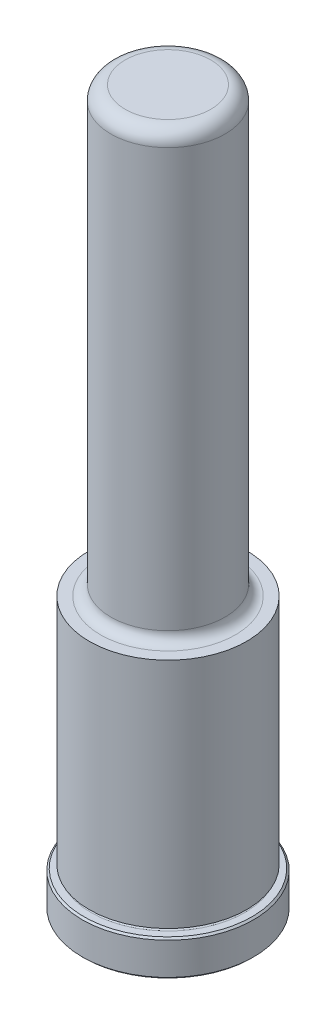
ISO-10303-21;
HEADER;
FILE_DESCRIPTION(('STEP AP214'),'2;1');
FILE_NAME('part.step','',(''),(''),'','','');
FILE_SCHEMA(('AUTOMOTIVE_DESIGN { 1 0 10303 214 1 1 1 1 }'));
ENDSEC;
DATA;
#1=APPLICATION_CONTEXT('core data for automotive mechanical design processes');
#2=APPLICATION_PROTOCOL_DEFINITION('international standard','automotive_design',2000,#1);
#3=PRODUCT_CONTEXT('',#1,'mechanical');
#4=PRODUCT('Part','Part','',(#3));
#5=PRODUCT_RELATED_PRODUCT_CATEGORY('part','',(#4));
#6=PRODUCT_DEFINITION_FORMATION('','',#4);
#7=PRODUCT_DEFINITION_CONTEXT('part definition',#1,'design');
#8=PRODUCT_DEFINITION('design','',#6,#7);
#9=PRODUCT_DEFINITION_SHAPE('','',#8);
#10=(LENGTH_UNIT() NAMED_UNIT(*) SI_UNIT(.MILLI.,.METRE.));
#11=(NAMED_UNIT(*) PLANE_ANGLE_UNIT() SI_UNIT($,.RADIAN.));
#12=(NAMED_UNIT(*) SI_UNIT($,.STERADIAN.) SOLID_ANGLE_UNIT());
#13=UNCERTAINTY_MEASURE_WITH_UNIT(LENGTH_MEASURE(1.E-05),#10,'distance_accuracy_value','');
#14=(GEOMETRIC_REPRESENTATION_CONTEXT(3) GLOBAL_UNCERTAINTY_ASSIGNED_CONTEXT((#13)) GLOBAL_UNIT_ASSIGNED_CONTEXT((#10,
#11,#12)) REPRESENTATION_CONTEXT('',''));
#15=CARTESIAN_POINT('',(0.,0.,0.));
#16=DIRECTION('',(0.,0.,1.));
#17=DIRECTION('',(1.,0.,0.));
#18=AXIS2_PLACEMENT_3D('',#15,#16,#17);
#19=CARTESIAN_POINT('',(0.,0.,0.));
#20=DIRECTION('',(0.,1.,0.));
#21=DIRECTION('',(0.,0.,1.));
#22=AXIS2_PLACEMENT_3D('',#19,#20,#21);
#23=PLANE('',#22);
#24=CARTESIAN_POINT('',(0.,0.,0.));
#25=DIRECTION('',(0.,1.,0.));
#26=DIRECTION('',(0.,0.,1.));
#27=AXIS2_PLACEMENT_3D('',#24,#25,#26);
#28=CIRCLE('',#27,18.669);
#29=CARTESIAN_POINT('',(0.,0.,18.669));
#30=VERTEX_POINT('',#29);
#31=EDGE_CURVE('E46',#30,#30,#28,.F.);
#32=ORIENTED_EDGE('',*,*,#31,.T.);
#33=EDGE_LOOP('',(#32));
#34=FACE_BOUND('',#33,.T.);
#35=ADVANCED_FACE('F31',(#34),#23,.F.);
#36=CARTESIAN_POINT('',(0.,0.,0.));
#37=DIRECTION('',(0.,1.,0.));
#38=DIRECTION('',(0.,0.,1.));
#39=AXIS2_PLACEMENT_3D('',#36,#37,#38);
#40=CYLINDRICAL_SURFACE('',#39,19.05);
#41=CARTESIAN_POINT('',(0.,0.380999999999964,0.));
#42=DIRECTION('',(0.,1.,0.));
#43=DIRECTION('',(0.,0.,1.));
#44=AXIS2_PLACEMENT_3D('',#41,#42,#43);
#45=CIRCLE('',#44,19.05);
#46=CARTESIAN_POINT('',(0.,0.380999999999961,19.05));
#47=VERTEX_POINT('',#46);
#48=EDGE_CURVE('E51',#47,#47,#45,.T.);
#49=ORIENTED_EDGE('',*,*,#48,.T.);
#50=EDGE_LOOP('',(#49));
#51=FACE_BOUND('',#50,.T.);
#52=CARTESIAN_POINT('',(0.,7.54380000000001,0.));
#53=DIRECTION('',(0.,-1.,0.));
#54=DIRECTION('',(0.,0.,-1.));
#55=AXIS2_PLACEMENT_3D('',#52,#53,#54);
#56=CIRCLE('',#55,19.05);
#57=CARTESIAN_POINT('',(0.,7.54380000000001,-19.05));
#58=VERTEX_POINT('',#57);
#59=EDGE_CURVE('E54',#58,#58,#56,.T.);
#60=ORIENTED_EDGE('',*,*,#59,.T.);
#61=EDGE_LOOP('',(#60));
#62=FACE_BOUND('',#61,.T.);
#63=ADVANCED_FACE('F110',(#51,#62),#40,.T.);
#64=CARTESIAN_POINT('',(0.,7.9248,-19.05));
#65=DIRECTION('',(0.,-1.,0.));
#66=DIRECTION('',(0.,0.,-1.));
#67=AXIS2_PLACEMENT_3D('',#64,#65,#66);
#68=PLANE('',#67);
#69=CARTESIAN_POINT('',(0.,7.9248,0.));
#70=DIRECTION('',(0.,-1.,0.));
#71=DIRECTION('',(0.,0.,-1.));
#72=AXIS2_PLACEMENT_3D('',#69,#70,#71);
#73=CIRCLE('',#72,18.669);
#74=CARTESIAN_POINT('',(0.,7.9248,-18.669));
#75=VERTEX_POINT('',#74);
#76=EDGE_CURVE('E42',#75,#75,#73,.F.);
#77=ORIENTED_EDGE('',*,*,#76,.T.);
#78=EDGE_LOOP('',(#77));
#79=FACE_BOUND('',#78,.T.);
#80=CARTESIAN_POINT('',(0.,7.9248,0.));
#81=DIRECTION('',(0.,1.,0.));
#82=DIRECTION('',(0.,0.,1.));
#83=AXIS2_PLACEMENT_3D('',#80,#81,#82);
#84=CIRCLE('',#83,17.0688);
#85=CARTESIAN_POINT('',(0.,7.92479999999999,17.0688));
#86=VERTEX_POINT('',#85);
#87=EDGE_CURVE('E57',#86,#86,#84,.T.);
#88=ORIENTED_EDGE('',*,*,#87,.F.);
#89=EDGE_LOOP('',(#88));
#90=FACE_BOUND('',#89,.T.);
#91=ADVANCED_FACE('F105',(#79,#90),#68,.F.);
#92=CARTESIAN_POINT('',(0.,8.3058,0.));
#93=DIRECTION('',(0.,1.,0.));
#94=DIRECTION('',(0.,0.,1.));
#95=AXIS2_PLACEMENT_3D('',#92,#93,#94);
#96=TOROIDAL_SURFACE('',#95,17.0688,0.381000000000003);
#97=CARTESIAN_POINT('',(0.,8.6868,0.));
#98=DIRECTION('',(0.,1.,0.));
#99=DIRECTION('',(0.,0.,1.));
#100=AXIS2_PLACEMENT_3D('',#97,#98,#99);
#101=CIRCLE('',#100,17.0688);
#102=CARTESIAN_POINT('',(0.,8.6868,17.0688));
#103=VERTEX_POINT('',#102);
#104=EDGE_CURVE('E60',#103,#103,#101,.T.);
#105=ORIENTED_EDGE('',*,*,#104,.F.);
#106=EDGE_LOOP('',(#105));
#107=FACE_BOUND('',#106,.T.);
#108=ORIENTED_EDGE('',*,*,#87,.T.);
#109=EDGE_LOOP('',(#108));
#110=FACE_BOUND('',#109,.T.);
#111=ADVANCED_FACE('F99',(#107,#110),#96,.F.);
#112=CARTESIAN_POINT('',(0.,8.6868,-17.0688));
#113=DIRECTION('',(0.,1.,0.));
#114=DIRECTION('',(0.,0.,1.));
#115=AXIS2_PLACEMENT_3D('',#112,#113,#114);
#116=PLANE('',#115);
#117=CARTESIAN_POINT('',(0.,8.6868,0.));
#118=DIRECTION('',(0.,1.,0.));
#119=DIRECTION('',(0.,0.,1.));
#120=AXIS2_PLACEMENT_3D('',#117,#118,#119);
#121=CIRCLE('',#120,17.4752);
#122=CARTESIAN_POINT('',(0.,8.6868,17.4752));
#123=VERTEX_POINT('',#122);
#124=EDGE_CURVE('E63',#123,#123,#121,.T.);
#125=ORIENTED_EDGE('',*,*,#124,.F.);
#126=EDGE_LOOP('',(#125));
#127=FACE_BOUND('',#126,.T.);
#128=ORIENTED_EDGE('',*,*,#104,.T.);
#129=EDGE_LOOP('',(#128));
#130=FACE_BOUND('',#129,.T.);
#131=ADVANCED_FACE('F93',(#127,#130),#116,.F.);
#132=CARTESIAN_POINT('',(0.,0.,0.));
#133=DIRECTION('',(0.,1.,0.));
#134=DIRECTION('',(0.,0.,1.));
#135=AXIS2_PLACEMENT_3D('',#132,#133,#134);
#136=CYLINDRICAL_SURFACE('',#135,17.4752);
#137=CARTESIAN_POINT('',(0.,60.325,0.));
#138=DIRECTION('',(0.,1.,0.));
#139=DIRECTION('',(0.,0.,1.));
#140=AXIS2_PLACEMENT_3D('',#137,#138,#139);
#141=CIRCLE('',#140,17.4752);
#142=CARTESIAN_POINT('',(0.,60.325,17.4752));
#143=VERTEX_POINT('',#142);
#144=EDGE_CURVE('E66',#143,#143,#141,.T.);
#145=ORIENTED_EDGE('',*,*,#144,.F.);
#146=EDGE_LOOP('',(#145));
#147=FACE_BOUND('',#146,.T.);
#148=ORIENTED_EDGE('',*,*,#124,.T.);
#149=EDGE_LOOP('',(#148));
#150=FACE_BOUND('',#149,.T.);
#151=ADVANCED_FACE('F87',(#147,#150),#136,.T.);
#152=CARTESIAN_POINT('',(0.,60.325,-17.4752));
#153=DIRECTION('',(0.,-1.,0.));
#154=DIRECTION('',(0.,0.,-1.));
#155=AXIS2_PLACEMENT_3D('',#152,#153,#154);
#156=PLANE('',#155);
#157=CARTESIAN_POINT('',(0.,60.325,0.));
#158=DIRECTION('',(0.,1.,0.));
#159=DIRECTION('',(0.,0.,1.));
#160=AXIS2_PLACEMENT_3D('',#157,#158,#159);
#161=CIRCLE('',#160,14.9733);
#162=CARTESIAN_POINT('',(0.,60.325,14.9733));
#163=VERTEX_POINT('',#162);
#164=EDGE_CURVE('E69',#163,#163,#161,.T.);
#165=ORIENTED_EDGE('',*,*,#164,.F.);
#166=EDGE_LOOP('',(#165));
#167=FACE_BOUND('',#166,.T.);
#168=ORIENTED_EDGE('',*,*,#144,.T.);
#169=EDGE_LOOP('',(#168));
#170=FACE_BOUND('',#169,.T.);
#171=ADVANCED_FACE('F81',(#167,#170),#156,.F.);
#172=CARTESIAN_POINT('',(0.,62.611,0.));
#173=DIRECTION('',(0.,1.,0.));
#174=DIRECTION('',(0.,0.,1.));
#175=AXIS2_PLACEMENT_3D('',#172,#173,#174);
#176=TOROIDAL_SURFACE('',#175,14.9733,2.286);
#177=CARTESIAN_POINT('',(0.,62.611,0.));
#178=DIRECTION('',(0.,1.,0.));
#179=DIRECTION('',(0.,0.,1.));
#180=AXIS2_PLACEMENT_3D('',#177,#178,#179);
#181=CIRCLE('',#180,12.6873);
#182=CARTESIAN_POINT('',(0.,62.611,12.6873));
#183=VERTEX_POINT('',#182);
#184=EDGE_CURVE('E72',#183,#183,#181,.T.);
#185=ORIENTED_EDGE('',*,*,#184,.F.);
#186=EDGE_LOOP('',(#185));
#187=FACE_BOUND('',#186,.T.);
#188=ORIENTED_EDGE('',*,*,#164,.T.);
#189=EDGE_LOOP('',(#188));
#190=FACE_BOUND('',#189,.T.);
#191=ADVANCED_FACE('F78',(#187,#190),#176,.F.);
#192=CARTESIAN_POINT('',(0.,0.,0.));
#193=DIRECTION('',(0.,1.,0.));
#194=DIRECTION('',(0.,0.,1.));
#195=AXIS2_PLACEMENT_3D('',#192,#193,#194);
#196=CYLINDRICAL_SURFACE('',#195,12.6873);
#197=CARTESIAN_POINT('',(0.,155.575,0.));
#198=DIRECTION('',(0.,-1.,0.));
#199=DIRECTION('',(0.,0.,-1.));
#200=AXIS2_PLACEMENT_3D('',#197,#198,#199);
#201=CIRCLE('',#200,12.6873);
#202=CARTESIAN_POINT('',(0.,155.575,-12.6873));
#203=VERTEX_POINT('',#202);
#204=EDGE_CURVE('E10',#203,#203,#201,.T.);
#205=ORIENTED_EDGE('',*,*,#204,.T.);
#206=EDGE_LOOP('',(#205));
#207=FACE_BOUND('',#206,.T.);
#208=ORIENTED_EDGE('',*,*,#184,.T.);
#209=EDGE_LOOP('',(#208));
#210=FACE_BOUND('',#209,.T.);
#211=ADVANCED_FACE('F76',(#207,#210),#196,.T.);
#212=CARTESIAN_POINT('',(0.,158.75,-12.6873));
#213=DIRECTION('',(0.,-1.,0.));
#214=DIRECTION('',(0.,0.,-1.));
#215=AXIS2_PLACEMENT_3D('',#212,#213,#214);
#216=PLANE('',#215);
#217=CARTESIAN_POINT('',(0.,158.75,0.));
#218=DIRECTION('',(0.,-1.,0.));
#219=DIRECTION('',(0.,0.,-1.));
#220=AXIS2_PLACEMENT_3D('',#217,#218,#219);
#221=CIRCLE('',#220,9.51230000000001);
#222=CARTESIAN_POINT('',(0.,158.75,-9.51229999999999));
#223=VERTEX_POINT('',#222);
#224=EDGE_CURVE('E38',#223,#223,#221,.F.);
#225=ORIENTED_EDGE('',*,*,#224,.T.);
#226=EDGE_LOOP('',(#225));
#227=FACE_BOUND('',#226,.T.);
#228=ADVANCED_FACE('F127',(#227),#216,.F.);
#229=CARTESIAN_POINT('',(0.,0.380999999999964,0.));
#230=DIRECTION('',(0.,1.,0.));
#231=DIRECTION('',(0.,0.,1.));
#232=AXIS2_PLACEMENT_3D('',#229,#230,#231);
#233=CONICAL_SURFACE('',#232,19.05,0.785398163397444);
#234=ORIENTED_EDGE('',*,*,#31,.F.);
#235=EDGE_LOOP('',(#234));
#236=FACE_BOUND('',#235,.T.);
#237=ORIENTED_EDGE('',*,*,#48,.F.);
#238=EDGE_LOOP('',(#237));
#239=FACE_BOUND('',#238,.T.);
#240=ADVANCED_FACE('F124',(#236,#239),#233,.T.);
#241=CARTESIAN_POINT('',(0.,7.9248,0.));
#242=DIRECTION('',(0.,-1.,0.));
#243=DIRECTION('',(0.,0.,-1.));
#244=AXIS2_PLACEMENT_3D('',#241,#242,#243);
#245=CONICAL_SURFACE('',#244,18.669,0.785398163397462);
#246=ORIENTED_EDGE('',*,*,#59,.F.);
#247=EDGE_LOOP('',(#246));
#248=FACE_BOUND('',#247,.T.);
#249=ORIENTED_EDGE('',*,*,#76,.F.);
#250=EDGE_LOOP('',(#249));
#251=FACE_BOUND('',#250,.T.);
#252=ADVANCED_FACE('F126',(#248,#251),#245,.T.);
#253=CARTESIAN_POINT('',(0.,155.575,0.));
#254=DIRECTION('',(0.,-1.,0.));
#255=DIRECTION('',(0.,0.,-1.));
#256=AXIS2_PLACEMENT_3D('',#253,#254,#255);
#257=TOROIDAL_SURFACE('',#256,9.51230000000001,3.175);
#258=ORIENTED_EDGE('',*,*,#204,.F.);
#259=EDGE_LOOP('',(#258));
#260=FACE_BOUND('',#259,.T.);
#261=ORIENTED_EDGE('',*,*,#224,.F.);
#262=EDGE_LOOP('',(#261));
#263=FACE_BOUND('',#262,.T.);
#264=ADVANCED_FACE('F33',(#260,#263),#257,.T.);
#265=CLOSED_SHELL('',(#35,#63,#91,#111,#131,#151,#171,#191,#211,#228,#240,#252,#264));
#266=MANIFOLD_SOLID_BREP('B2',#265);
#267=ADVANCED_BREP_SHAPE_REPRESENTATION('',(#18,#266),#14);
#268=SHAPE_DEFINITION_REPRESENTATION(#9,#267);
ENDSEC;
END-ISO-10303-21;
